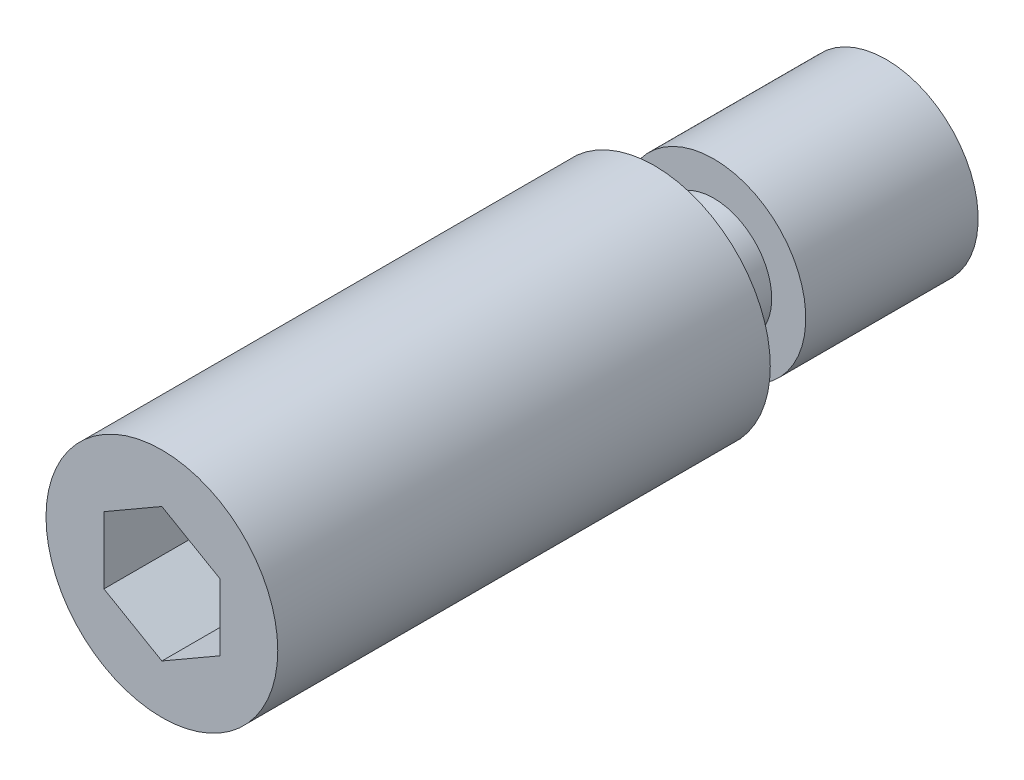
ISO-10303-21;
HEADER;
FILE_DESCRIPTION(('STEP AP214'),'2;1');
FILE_NAME('part.step','',(''),(''),'','','');
FILE_SCHEMA(('AUTOMOTIVE_DESIGN { 1 0 10303 214 1 1 1 1 }'));
ENDSEC;
DATA;
#1=APPLICATION_CONTEXT('core data for automotive mechanical design processes');
#2=APPLICATION_PROTOCOL_DEFINITION('international standard','automotive_design',2000,#1);
#3=PRODUCT_CONTEXT('',#1,'mechanical');
#4=PRODUCT('Part','Part','',(#3));
#5=PRODUCT_RELATED_PRODUCT_CATEGORY('part','',(#4));
#6=PRODUCT_DEFINITION_FORMATION('','',#4);
#7=PRODUCT_DEFINITION_CONTEXT('part definition',#1,'design');
#8=PRODUCT_DEFINITION('design','',#6,#7);
#9=PRODUCT_DEFINITION_SHAPE('','',#8);
#10=(LENGTH_UNIT() NAMED_UNIT(*) SI_UNIT(.MILLI.,.METRE.));
#11=(NAMED_UNIT(*) PLANE_ANGLE_UNIT() SI_UNIT($,.RADIAN.));
#12=(NAMED_UNIT(*) SI_UNIT($,.STERADIAN.) SOLID_ANGLE_UNIT());
#13=UNCERTAINTY_MEASURE_WITH_UNIT(LENGTH_MEASURE(1.E-05),#10,'distance_accuracy_value','');
#14=(GEOMETRIC_REPRESENTATION_CONTEXT(3) GLOBAL_UNCERTAINTY_ASSIGNED_CONTEXT((#13)) GLOBAL_UNIT_ASSIGNED_CONTEXT((#10,
#11,#12)) REPRESENTATION_CONTEXT('',''));
#15=CARTESIAN_POINT('',(0.,0.,0.));
#16=DIRECTION('',(0.,0.,1.));
#17=DIRECTION('',(1.,0.,0.));
#18=AXIS2_PLACEMENT_3D('',#15,#16,#17);
#19=CARTESIAN_POINT('',(0.,-8.,16.));
#20=DIRECTION('',(0.,0.,-1.));
#21=DIRECTION('',(0.,-1.,0.));
#22=AXIS2_PLACEMENT_3D('',#19,#20,#21);
#23=PLANE('',#22);
#24=CARTESIAN_POINT('',(0.,0.,16.));
#25=DIRECTION('',(0.,0.,1.));
#26=DIRECTION('',(0.,1.,0.));
#27=AXIS2_PLACEMENT_3D('',#24,#25,#26);
#28=CIRCLE('',#27,4.);
#29=CARTESIAN_POINT('',(0.,4.,16.));
#30=VERTEX_POINT('',#29);
#31=EDGE_CURVE('E115',#30,#30,#28,.T.);
#32=ORIENTED_EDGE('',*,*,#31,.T.);
#33=EDGE_LOOP('',(#32));
#34=FACE_BOUND('',#33,.T.);
#35=CARTESIAN_POINT('',(0.,0.,16.));
#36=DIRECTION('',(0.,0.,1.));
#37=DIRECTION('',(0.,1.,0.));
#38=AXIS2_PLACEMENT_3D('',#35,#36,#37);
#39=CIRCLE('',#38,8.);
#40=CARTESIAN_POINT('',(0.,8.,16.));
#41=VERTEX_POINT('',#40);
#42=EDGE_CURVE('E9',#41,#41,#39,.T.);
#43=ORIENTED_EDGE('',*,*,#42,.F.);
#44=EDGE_LOOP('',(#43));
#45=FACE_BOUND('',#44,.T.);
#46=ADVANCED_FACE('F14',(#34,#45),#23,.T.);
#47=CARTESIAN_POINT('',(0.,0.,20.));
#48=DIRECTION('',(0.,0.,1.));
#49=DIRECTION('',(0.,1.,0.));
#50=AXIS2_PLACEMENT_3D('',#47,#48,#49);
#51=CYLINDRICAL_SURFACE('',#50,8.);
#52=CARTESIAN_POINT('',(0.,0.,50.));
#53=DIRECTION('',(0.,0.,1.));
#54=DIRECTION('',(0.,1.,0.));
#55=AXIS2_PLACEMENT_3D('',#52,#53,#54);
#56=CIRCLE('',#55,8.);
#57=CARTESIAN_POINT('',(0.,8.,50.));
#58=VERTEX_POINT('',#57);
#59=EDGE_CURVE('E21',#58,#58,#56,.T.);
#60=ORIENTED_EDGE('',*,*,#59,.F.);
#61=EDGE_LOOP('',(#60));
#62=FACE_BOUND('',#61,.T.);
#63=ORIENTED_EDGE('',*,*,#42,.T.);
#64=EDGE_LOOP('',(#63));
#65=FACE_BOUND('',#64,.T.);
#66=ADVANCED_FACE('F136',(#62,#65),#51,.T.);
#67=CARTESIAN_POINT('',(0.,-8.,50.));
#68=DIRECTION('',(0.,0.,-1.));
#69=DIRECTION('',(0.,-1.,0.));
#70=AXIS2_PLACEMENT_3D('',#67,#68,#69);
#71=PLANE('',#70);
#72=DIRECTION('',(-0.866025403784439,-0.5,0.));
#73=VECTOR('',#72,1.);
#74=CARTESIAN_POINT('',(0.,4.61880215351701,50.));
#75=LINE('',#74,#73);
#76=CARTESIAN_POINT('',(0.,4.61880215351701,50.));
#77=VERTEX_POINT('',#76);
#78=CARTESIAN_POINT('',(-4.,2.30940107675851,50.));
#79=VERTEX_POINT('',#78);
#80=EDGE_CURVE('E102',#77,#79,#75,.T.);
#81=ORIENTED_EDGE('',*,*,#80,.F.);
#82=DIRECTION('',(-0.866025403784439,0.5,0.));
#83=VECTOR('',#82,1.);
#84=CARTESIAN_POINT('',(4.,2.30940107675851,50.));
#85=LINE('',#84,#83);
#86=CARTESIAN_POINT('',(4.,2.30940107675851,50.));
#87=VERTEX_POINT('',#86);
#88=EDGE_CURVE('E28',#87,#77,#85,.T.);
#89=ORIENTED_EDGE('',*,*,#88,.F.);
#90=DIRECTION('',(0.,1.,0.));
#91=VECTOR('',#90,1.);
#92=CARTESIAN_POINT('',(4.,-2.30940107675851,50.));
#93=LINE('',#92,#91);
#94=CARTESIAN_POINT('',(4.,-2.30940107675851,50.));
#95=VERTEX_POINT('',#94);
#96=EDGE_CURVE('E111',#95,#87,#93,.T.);
#97=ORIENTED_EDGE('',*,*,#96,.F.);
#98=DIRECTION('',(0.866025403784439,0.5,0.));
#99=VECTOR('',#98,1.);
#100=CARTESIAN_POINT('',(0.,-4.61880215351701,50.));
#101=LINE('',#100,#99);
#102=CARTESIAN_POINT('',(0.,-4.61880215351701,50.));
#103=VERTEX_POINT('',#102);
#104=EDGE_CURVE('E109',#103,#95,#101,.T.);
#105=ORIENTED_EDGE('',*,*,#104,.F.);
#106=DIRECTION('',(0.866025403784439,-0.5,0.));
#107=VECTOR('',#106,1.);
#108=CARTESIAN_POINT('',(-4.,-2.30940107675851,50.));
#109=LINE('',#108,#107);
#110=CARTESIAN_POINT('',(-4.,-2.30940107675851,50.));
#111=VERTEX_POINT('',#110);
#112=EDGE_CURVE('E76',#111,#103,#109,.T.);
#113=ORIENTED_EDGE('',*,*,#112,.F.);
#114=DIRECTION('',(0.,-1.,0.));
#115=VECTOR('',#114,1.);
#116=CARTESIAN_POINT('',(-4.,2.30940107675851,50.));
#117=LINE('',#116,#115);
#118=EDGE_CURVE('E105',#79,#111,#117,.T.);
#119=ORIENTED_EDGE('',*,*,#118,.F.);
#120=EDGE_LOOP('',(#81,#89,#97,#105,#113,#119));
#121=FACE_BOUND('',#120,.T.);
#122=ORIENTED_EDGE('',*,*,#59,.T.);
#123=EDGE_LOOP('',(#122));
#124=FACE_BOUND('',#123,.T.);
#125=ADVANCED_FACE('F134',(#121,#124),#71,.F.);
#126=CARTESIAN_POINT('',(0.,-6.35,0.));
#127=DIRECTION('',(0.,0.,-1.));
#128=DIRECTION('',(0.,-1.,0.));
#129=AXIS2_PLACEMENT_3D('',#126,#127,#128);
#130=PLANE('',#129);
#131=CARTESIAN_POINT('',(0.,0.,0.));
#132=DIRECTION('',(0.,0.,1.));
#133=DIRECTION('',(0.,1.,0.));
#134=AXIS2_PLACEMENT_3D('',#131,#132,#133);
#135=CIRCLE('',#134,6.35);
#136=CARTESIAN_POINT('',(0.,6.35,0.));
#137=VERTEX_POINT('',#136);
#138=EDGE_CURVE('E129',#137,#137,#135,.T.);
#139=ORIENTED_EDGE('',*,*,#138,.F.);
#140=EDGE_LOOP('',(#139));
#141=FACE_BOUND('',#140,.T.);
#142=ADVANCED_FACE('F167',(#141),#130,.T.);
#143=CARTESIAN_POINT('',(0.,0.,20.));
#144=DIRECTION('',(0.,0.,1.));
#145=DIRECTION('',(0.,1.,0.));
#146=AXIS2_PLACEMENT_3D('',#143,#144,#145);
#147=CYLINDRICAL_SURFACE('',#146,6.35);
#148=ORIENTED_EDGE('',*,*,#138,.T.);
#149=EDGE_LOOP('',(#148));
#150=FACE_BOUND('',#149,.T.);
#151=CARTESIAN_POINT('',(0.,0.,11.9));
#152=DIRECTION('',(0.,0.,1.));
#153=DIRECTION('',(0.,1.,0.));
#154=AXIS2_PLACEMENT_3D('',#151,#152,#153);
#155=CIRCLE('',#154,6.35);
#156=CARTESIAN_POINT('',(0.,6.35,11.9));
#157=VERTEX_POINT('',#156);
#158=EDGE_CURVE('E126',#157,#157,#155,.T.);
#159=ORIENTED_EDGE('',*,*,#158,.F.);
#160=EDGE_LOOP('',(#159));
#161=FACE_BOUND('',#160,.T.);
#162=ADVANCED_FACE('F160',(#150,#161),#147,.T.);
#163=CARTESIAN_POINT('',(0.,-4.,11.9));
#164=DIRECTION('',(0.,0.,1.));
#165=DIRECTION('',(0.,1.,0.));
#166=AXIS2_PLACEMENT_3D('',#163,#164,#165);
#167=PLANE('',#166);
#168=ORIENTED_EDGE('',*,*,#158,.T.);
#169=EDGE_LOOP('',(#168));
#170=FACE_BOUND('',#169,.T.);
#171=CARTESIAN_POINT('',(0.,0.,11.9));
#172=DIRECTION('',(0.,0.,1.));
#173=DIRECTION('',(0.,1.,0.));
#174=AXIS2_PLACEMENT_3D('',#171,#172,#173);
#175=CIRCLE('',#174,4.);
#176=CARTESIAN_POINT('',(0.,4.,11.9));
#177=VERTEX_POINT('',#176);
#178=EDGE_CURVE('E123',#177,#177,#175,.T.);
#179=ORIENTED_EDGE('',*,*,#178,.F.);
#180=EDGE_LOOP('',(#179));
#181=FACE_BOUND('',#180,.T.);
#182=ADVANCED_FACE('F151',(#170,#181),#167,.T.);
#183=CARTESIAN_POINT('',(0.,0.,20.));
#184=DIRECTION('',(0.,0.,1.));
#185=DIRECTION('',(0.,1.,0.));
#186=AXIS2_PLACEMENT_3D('',#183,#184,#185);
#187=CYLINDRICAL_SURFACE('',#186,4.);
#188=ORIENTED_EDGE('',*,*,#178,.T.);
#189=EDGE_LOOP('',(#188));
#190=FACE_BOUND('',#189,.T.);
#191=ORIENTED_EDGE('',*,*,#31,.F.);
#192=EDGE_LOOP('',(#191));
#193=FACE_BOUND('',#192,.T.);
#194=ADVANCED_FACE('F148',(#190,#193),#187,.T.);
#195=CARTESIAN_POINT('',(4.,2.30940107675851,40.));
#196=DIRECTION('',(0.5,0.866025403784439,0.));
#197=DIRECTION('',(-0.866025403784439,0.5,0.));
#198=AXIS2_PLACEMENT_3D('',#195,#196,#197);
#199=PLANE('',#198);
#200=ORIENTED_EDGE('',*,*,#88,.T.);
#201=DIRECTION('',(0.,0.,1.));
#202=VECTOR('',#201,1.);
#203=CARTESIAN_POINT('',(0.,4.61880215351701,40.));
#204=LINE('',#203,#202);
#205=CARTESIAN_POINT('',(0.,4.61880215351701,40.));
#206=VERTEX_POINT('',#205);
#207=EDGE_CURVE('E58',#206,#77,#204,.T.);
#208=ORIENTED_EDGE('',*,*,#207,.F.);
#209=DIRECTION('',(-0.866025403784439,0.5,0.));
#210=VECTOR('',#209,1.);
#211=CARTESIAN_POINT('',(4.,2.30940107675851,40.));
#212=LINE('',#211,#210);
#213=CARTESIAN_POINT('',(4.,2.30940107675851,40.));
#214=VERTEX_POINT('',#213);
#215=EDGE_CURVE('E113',#214,#206,#212,.T.);
#216=ORIENTED_EDGE('',*,*,#215,.F.);
#217=DIRECTION('',(0.,0.,1.));
#218=VECTOR('',#217,1.);
#219=CARTESIAN_POINT('',(4.,2.30940107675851,40.));
#220=LINE('',#219,#218);
#221=EDGE_CURVE('E36',#214,#87,#220,.T.);
#222=ORIENTED_EDGE('',*,*,#221,.T.);
#223=EDGE_LOOP('',(#200,#208,#216,#222));
#224=FACE_BOUND('',#223,.T.);
#225=ADVANCED_FACE('F150',(#224),#199,.F.);
#226=CARTESIAN_POINT('',(4.,-2.30940107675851,40.));
#227=DIRECTION('',(1.,0.,0.));
#228=DIRECTION('',(0.,0.,-1.));
#229=AXIS2_PLACEMENT_3D('',#226,#227,#228);
#230=PLANE('',#229);
#231=ORIENTED_EDGE('',*,*,#96,.T.);
#232=ORIENTED_EDGE('',*,*,#221,.F.);
#233=DIRECTION('',(0.,1.,0.));
#234=VECTOR('',#233,1.);
#235=CARTESIAN_POINT('',(4.,-2.30940107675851,40.));
#236=LINE('',#235,#234);
#237=CARTESIAN_POINT('',(4.,-2.30940107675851,40.));
#238=VERTEX_POINT('',#237);
#239=EDGE_CURVE('E88',#238,#214,#236,.T.);
#240=ORIENTED_EDGE('',*,*,#239,.F.);
#241=DIRECTION('',(0.,0.,1.));
#242=VECTOR('',#241,1.);
#243=CARTESIAN_POINT('',(4.,-2.30940107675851,40.));
#244=LINE('',#243,#242);
#245=EDGE_CURVE('E80',#238,#95,#244,.T.);
#246=ORIENTED_EDGE('',*,*,#245,.T.);
#247=EDGE_LOOP('',(#231,#232,#240,#246));
#248=FACE_BOUND('',#247,.T.);
#249=ADVANCED_FACE('F158',(#248),#230,.F.);
#250=CARTESIAN_POINT('',(0.,-4.61880215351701,40.));
#251=DIRECTION('',(0.5,-0.866025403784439,0.));
#252=DIRECTION('',(0.866025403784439,0.5,0.));
#253=AXIS2_PLACEMENT_3D('',#250,#251,#252);
#254=PLANE('',#253);
#255=ORIENTED_EDGE('',*,*,#104,.T.);
#256=ORIENTED_EDGE('',*,*,#245,.F.);
#257=DIRECTION('',(0.866025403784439,0.5,0.));
#258=VECTOR('',#257,1.);
#259=CARTESIAN_POINT('',(0.,-4.61880215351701,40.));
#260=LINE('',#259,#258);
#261=CARTESIAN_POINT('',(0.,-4.61880215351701,40.));
#262=VERTEX_POINT('',#261);
#263=EDGE_CURVE('E84',#262,#238,#260,.T.);
#264=ORIENTED_EDGE('',*,*,#263,.F.);
#265=DIRECTION('',(0.,0.,1.));
#266=VECTOR('',#265,1.);
#267=CARTESIAN_POINT('',(0.,-4.61880215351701,40.));
#268=LINE('',#267,#266);
#269=EDGE_CURVE('E69',#262,#103,#268,.T.);
#270=ORIENTED_EDGE('',*,*,#269,.T.);
#271=EDGE_LOOP('',(#255,#256,#264,#270));
#272=FACE_BOUND('',#271,.T.);
#273=ADVANCED_FACE('F85',(#272),#254,.F.);
#274=CARTESIAN_POINT('',(-4.,-2.30940107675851,40.));
#275=DIRECTION('',(-0.5,-0.866025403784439,0.));
#276=DIRECTION('',(0.866025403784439,-0.5,0.));
#277=AXIS2_PLACEMENT_3D('',#274,#275,#276);
#278=PLANE('',#277);
#279=ORIENTED_EDGE('',*,*,#112,.T.);
#280=ORIENTED_EDGE('',*,*,#269,.F.);
#281=DIRECTION('',(0.866025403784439,-0.5,0.));
#282=VECTOR('',#281,1.);
#283=CARTESIAN_POINT('',(-4.,-2.30940107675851,40.));
#284=LINE('',#283,#282);
#285=CARTESIAN_POINT('',(-4.,-2.30940107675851,40.));
#286=VERTEX_POINT('',#285);
#287=EDGE_CURVE('E73',#286,#262,#284,.T.);
#288=ORIENTED_EDGE('',*,*,#287,.F.);
#289=DIRECTION('',(0.,0.,1.));
#290=VECTOR('',#289,1.);
#291=CARTESIAN_POINT('',(-4.,-2.30940107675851,40.));
#292=LINE('',#291,#290);
#293=EDGE_CURVE('E81',#286,#111,#292,.T.);
#294=ORIENTED_EDGE('',*,*,#293,.T.);
#295=EDGE_LOOP('',(#279,#280,#288,#294));
#296=FACE_BOUND('',#295,.T.);
#297=ADVANCED_FACE('F71',(#296),#278,.F.);
#298=CARTESIAN_POINT('',(-4.,2.30940107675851,40.));
#299=DIRECTION('',(-1.,0.,0.));
#300=DIRECTION('',(0.,0.,1.));
#301=AXIS2_PLACEMENT_3D('',#298,#299,#300);
#302=PLANE('',#301);
#303=ORIENTED_EDGE('',*,*,#118,.T.);
#304=ORIENTED_EDGE('',*,*,#293,.F.);
#305=DIRECTION('',(0.,-1.,0.));
#306=VECTOR('',#305,1.);
#307=CARTESIAN_POINT('',(-4.,2.30940107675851,40.));
#308=LINE('',#307,#306);
#309=CARTESIAN_POINT('',(-4.,2.30940107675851,40.));
#310=VERTEX_POINT('',#309);
#311=EDGE_CURVE('E94',#310,#286,#308,.T.);
#312=ORIENTED_EDGE('',*,*,#311,.F.);
#313=DIRECTION('',(0.,0.,1.));
#314=VECTOR('',#313,1.);
#315=CARTESIAN_POINT('',(-4.,2.30940107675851,40.));
#316=LINE('',#315,#314);
#317=EDGE_CURVE('E118',#310,#79,#316,.T.);
#318=ORIENTED_EDGE('',*,*,#317,.T.);
#319=EDGE_LOOP('',(#303,#304,#312,#318));
#320=FACE_BOUND('',#319,.T.);
#321=ADVANCED_FACE('F192',(#320),#302,.F.);
#322=CARTESIAN_POINT('',(0.,4.61880215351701,40.));
#323=DIRECTION('',(-0.5,0.866025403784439,0.));
#324=DIRECTION('',(-0.866025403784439,-0.5,0.));
#325=AXIS2_PLACEMENT_3D('',#322,#323,#324);
#326=PLANE('',#325);
#327=ORIENTED_EDGE('',*,*,#80,.T.);
#328=ORIENTED_EDGE('',*,*,#317,.F.);
#329=DIRECTION('',(-0.866025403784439,-0.5,0.));
#330=VECTOR('',#329,1.);
#331=CARTESIAN_POINT('',(0.,4.61880215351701,40.));
#332=LINE('',#331,#330);
#333=EDGE_CURVE('E96',#206,#310,#332,.T.);
#334=ORIENTED_EDGE('',*,*,#333,.F.);
#335=ORIENTED_EDGE('',*,*,#207,.T.);
#336=EDGE_LOOP('',(#327,#328,#334,#335));
#337=FACE_BOUND('',#336,.T.);
#338=ADVANCED_FACE('F180',(#337),#326,.F.);
#339=CARTESIAN_POINT('',(0.,4.61880215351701,40.));
#340=DIRECTION('',(0.,0.,1.));
#341=DIRECTION('',(1.,0.,0.));
#342=AXIS2_PLACEMENT_3D('',#339,#340,#341);
#343=PLANE('',#342);
#344=ORIENTED_EDGE('',*,*,#215,.T.);
#345=ORIENTED_EDGE('',*,*,#333,.T.);
#346=ORIENTED_EDGE('',*,*,#311,.T.);
#347=ORIENTED_EDGE('',*,*,#287,.T.);
#348=ORIENTED_EDGE('',*,*,#263,.T.);
#349=ORIENTED_EDGE('',*,*,#239,.T.);
#350=EDGE_LOOP('',(#344,#345,#346,#347,#348,#349));
#351=FACE_BOUND('',#350,.T.);
#352=ADVANCED_FACE('F91',(#351),#343,.T.);
#353=CLOSED_SHELL('',(#46,#66,#125,#142,#162,#182,#194,#225,#249,#273,#297,#321,#338,#352));
#354=MANIFOLD_SOLID_BREP('B1',#353);
#355=ADVANCED_BREP_SHAPE_REPRESENTATION('',(#18,#354),#14);
#356=SHAPE_DEFINITION_REPRESENTATION(#9,#355);
ENDSEC;
END-ISO-10303-21;
